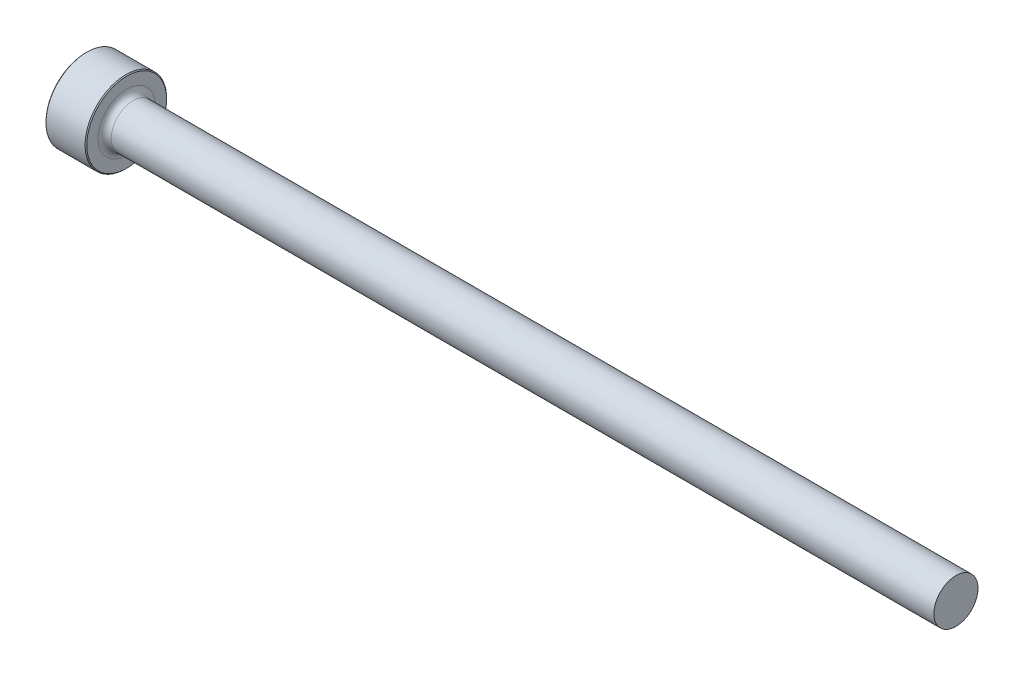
ISO-10303-21;
HEADER;
FILE_DESCRIPTION(('STEP AP214'),'2;1');
FILE_NAME('part.step','',(''),(''),'','','');
FILE_SCHEMA(('AUTOMOTIVE_DESIGN { 1 0 10303 214 1 1 1 1 }'));
ENDSEC;
DATA;
#1=APPLICATION_CONTEXT('core data for automotive mechanical design processes');
#2=APPLICATION_PROTOCOL_DEFINITION('international standard','automotive_design',2000,#1);
#3=PRODUCT_CONTEXT('',#1,'mechanical');
#4=PRODUCT('Part','Part','',(#3));
#5=PRODUCT_RELATED_PRODUCT_CATEGORY('part','',(#4));
#6=PRODUCT_DEFINITION_FORMATION('','',#4);
#7=PRODUCT_DEFINITION_CONTEXT('part definition',#1,'design');
#8=PRODUCT_DEFINITION('design','',#6,#7);
#9=PRODUCT_DEFINITION_SHAPE('','',#8);
#10=(LENGTH_UNIT() NAMED_UNIT(*) SI_UNIT(.MILLI.,.METRE.));
#11=(NAMED_UNIT(*) PLANE_ANGLE_UNIT() SI_UNIT($,.RADIAN.));
#12=(NAMED_UNIT(*) SI_UNIT($,.STERADIAN.) SOLID_ANGLE_UNIT());
#13=UNCERTAINTY_MEASURE_WITH_UNIT(LENGTH_MEASURE(1.E-05),#10,'distance_accuracy_value','');
#14=(GEOMETRIC_REPRESENTATION_CONTEXT(3) GLOBAL_UNCERTAINTY_ASSIGNED_CONTEXT((#13)) GLOBAL_UNIT_ASSIGNED_CONTEXT((#10,
#11,#12)) REPRESENTATION_CONTEXT('',''));
#15=CARTESIAN_POINT('',(0.,0.,0.));
#16=DIRECTION('',(0.,0.,1.));
#17=DIRECTION('',(1.,0.,0.));
#18=AXIS2_PLACEMENT_3D('',#15,#16,#17);
#19=CARTESIAN_POINT('',(101.6,2.57587749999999,0.));
#20=DIRECTION('',(1.,0.,0.));
#21=DIRECTION('',(0.,1.,0.));
#22=AXIS2_PLACEMENT_3D('',#19,#20,#21);
#23=PLANE('',#22);
#24=CARTESIAN_POINT('',(101.6,0.,0.));
#25=DIRECTION('',(1.,0.,0.));
#26=DIRECTION('',(0.,1.,0.));
#27=AXIS2_PLACEMENT_3D('',#24,#25,#26);
#28=CIRCLE('',#27,2.5758775);
#29=CARTESIAN_POINT('',(101.6,2.57587749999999,0.));
#30=VERTEX_POINT('',#29);
#31=EDGE_CURVE('E50',#30,#30,#28,.T.);
#32=ORIENTED_EDGE('',*,*,#31,.T.);
#33=EDGE_LOOP('',(#32));
#34=FACE_BOUND('',#33,.T.);
#35=ADVANCED_FACE('F30',(#34),#23,.T.);
#36=CARTESIAN_POINT('',(101.6,0.,0.));
#37=DIRECTION('',(1.,0.,0.));
#38=DIRECTION('',(0.,1.,0.));
#39=AXIS2_PLACEMENT_3D('',#36,#37,#38);
#40=CYLINDRICAL_SURFACE('',#39,2.5758775);
#41=CARTESIAN_POINT('',(5.5245,0.,0.));
#42=DIRECTION('',(1.,0.,0.));
#43=DIRECTION('',(0.,1.,0.));
#44=AXIS2_PLACEMENT_3D('',#41,#42,#43);
#45=CIRCLE('',#44,2.57587749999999);
#46=CARTESIAN_POINT('',(5.5245,2.57587749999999,0.));
#47=VERTEX_POINT('',#46);
#48=EDGE_CURVE('E53',#47,#47,#45,.T.);
#49=ORIENTED_EDGE('',*,*,#48,.T.);
#50=EDGE_LOOP('',(#49));
#51=FACE_BOUND('',#50,.T.);
#52=ORIENTED_EDGE('',*,*,#31,.F.);
#53=EDGE_LOOP('',(#52));
#54=FACE_BOUND('',#53,.T.);
#55=ADVANCED_FACE('F74',(#51,#54),#40,.T.);
#56=CARTESIAN_POINT('',(5.5245,0.,0.));
#57=DIRECTION('',(1.,0.,0.));
#58=DIRECTION('',(0.,1.,0.));
#59=AXIS2_PLACEMENT_3D('',#56,#57,#58);
#60=TOROIDAL_SURFACE('',#59,3.33787749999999,0.762);
#61=CARTESIAN_POINT('',(4.7625,0.,0.));
#62=DIRECTION('',(1.,0.,0.));
#63=DIRECTION('',(0.,1.,0.));
#64=AXIS2_PLACEMENT_3D('',#61,#62,#63);
#65=CIRCLE('',#64,3.33787749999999);
#66=CARTESIAN_POINT('',(4.7625,3.33787749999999,0.));
#67=VERTEX_POINT('',#66);
#68=EDGE_CURVE('E56',#67,#67,#65,.T.);
#69=ORIENTED_EDGE('',*,*,#68,.T.);
#70=EDGE_LOOP('',(#69));
#71=FACE_BOUND('',#70,.T.);
#72=ORIENTED_EDGE('',*,*,#48,.F.);
#73=EDGE_LOOP('',(#72));
#74=FACE_BOUND('',#73,.T.);
#75=ADVANCED_FACE('F60',(#71,#74),#60,.F.);
#76=CARTESIAN_POINT('',(4.7625,4.7625,0.));
#77=DIRECTION('',(1.,0.,0.));
#78=DIRECTION('',(0.,1.,0.));
#79=AXIS2_PLACEMENT_3D('',#76,#77,#78);
#80=PLANE('',#79);
#81=CARTESIAN_POINT('',(4.7625,0.,0.));
#82=DIRECTION('',(1.,0.,0.));
#83=DIRECTION('',(0.,1.,0.));
#84=AXIS2_PLACEMENT_3D('',#81,#82,#83);
#85=CIRCLE('',#84,4.6609);
#86=CARTESIAN_POINT('',(4.7625,4.6609,0.));
#87=VERTEX_POINT('',#86);
#88=EDGE_CURVE('E10',#87,#87,#85,.T.);
#89=ORIENTED_EDGE('',*,*,#88,.T.);
#90=EDGE_LOOP('',(#89));
#91=FACE_BOUND('',#90,.T.);
#92=ORIENTED_EDGE('',*,*,#68,.F.);
#93=EDGE_LOOP('',(#92));
#94=FACE_BOUND('',#93,.T.);
#95=ADVANCED_FACE('F63',(#91,#94),#80,.T.);
#96=CARTESIAN_POINT('',(101.6,0.,0.));
#97=DIRECTION('',(1.,0.,0.));
#98=DIRECTION('',(0.,1.,0.));
#99=AXIS2_PLACEMENT_3D('',#96,#97,#98);
#100=CYLINDRICAL_SURFACE('',#99,4.7625);
#101=CARTESIAN_POINT('',(0.101599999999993,0.,0.));
#102=DIRECTION('',(-1.,0.,0.));
#103=DIRECTION('',(0.,-1.,0.));
#104=AXIS2_PLACEMENT_3D('',#101,#102,#103);
#105=CIRCLE('',#104,4.7625);
#106=CARTESIAN_POINT('',(0.101599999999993,-4.7625,0.));
#107=VERTEX_POINT('',#106);
#108=EDGE_CURVE('E41',#107,#107,#105,.F.);
#109=ORIENTED_EDGE('',*,*,#108,.T.);
#110=EDGE_LOOP('',(#109));
#111=FACE_BOUND('',#110,.T.);
#112=CARTESIAN_POINT('',(4.66089999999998,0.,0.));
#113=DIRECTION('',(1.,0.,0.));
#114=DIRECTION('',(0.,1.,0.));
#115=AXIS2_PLACEMENT_3D('',#112,#113,#114);
#116=CIRCLE('',#115,4.7625);
#117=CARTESIAN_POINT('',(4.66089999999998,4.7625,0.));
#118=VERTEX_POINT('',#117);
#119=EDGE_CURVE('E45',#118,#118,#116,.F.);
#120=ORIENTED_EDGE('',*,*,#119,.T.);
#121=EDGE_LOOP('',(#120));
#122=FACE_BOUND('',#121,.T.);
#123=ADVANCED_FACE('F65',(#111,#122),#100,.T.);
#124=CARTESIAN_POINT('',(0.,0.,0.));
#125=DIRECTION('',(-1.,0.,0.));
#126=DIRECTION('',(0.,-1.,0.));
#127=AXIS2_PLACEMENT_3D('',#124,#125,#126);
#128=PLANE('',#127);
#129=CARTESIAN_POINT('',(0.,0.,0.));
#130=DIRECTION('',(-1.,0.,0.));
#131=DIRECTION('',(0.,-1.,0.));
#132=AXIS2_PLACEMENT_3D('',#129,#130,#131);
#133=CIRCLE('',#132,4.66089999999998);
#134=CARTESIAN_POINT('',(0.,-4.66089999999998,0.));
#135=VERTEX_POINT('',#134);
#136=EDGE_CURVE('E37',#135,#135,#133,.T.);
#137=ORIENTED_EDGE('',*,*,#136,.T.);
#138=EDGE_LOOP('',(#137));
#139=FACE_BOUND('',#138,.T.);
#140=ADVANCED_FACE('F71',(#139),#128,.T.);
#141=CARTESIAN_POINT('',(0.101599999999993,0.,0.));
#142=DIRECTION('',(1.,0.,0.));
#143=DIRECTION('',(0.,1.,0.));
#144=AXIS2_PLACEMENT_3D('',#141,#142,#143);
#145=CONICAL_SURFACE('',#144,4.7625,0.785398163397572);
#146=ORIENTED_EDGE('',*,*,#136,.F.);
#147=EDGE_LOOP('',(#146));
#148=FACE_BOUND('',#147,.T.);
#149=ORIENTED_EDGE('',*,*,#108,.F.);
#150=EDGE_LOOP('',(#149));
#151=FACE_BOUND('',#150,.T.);
#152=ADVANCED_FACE('F84',(#148,#151),#145,.T.);
#153=CARTESIAN_POINT('',(4.7625,0.,0.));
#154=DIRECTION('',(-1.,0.,0.));
#155=DIRECTION('',(0.,-1.,0.));
#156=AXIS2_PLACEMENT_3D('',#153,#154,#155);
#157=CONICAL_SURFACE('',#156,4.6609,0.785398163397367);
#158=ORIENTED_EDGE('',*,*,#119,.F.);
#159=EDGE_LOOP('',(#158));
#160=FACE_BOUND('',#159,.T.);
#161=ORIENTED_EDGE('',*,*,#88,.F.);
#162=EDGE_LOOP('',(#161));
#163=FACE_BOUND('',#162,.T.);
#164=ADVANCED_FACE('F32',(#160,#163),#157,.T.);
#165=CLOSED_SHELL('',(#35,#55,#75,#95,#123,#140,#152,#164));
#166=MANIFOLD_SOLID_BREP('B2',#165);
#167=ADVANCED_BREP_SHAPE_REPRESENTATION('',(#18,#166),#14);
#168=SHAPE_DEFINITION_REPRESENTATION(#9,#167);
ENDSEC;
END-ISO-10303-21;
